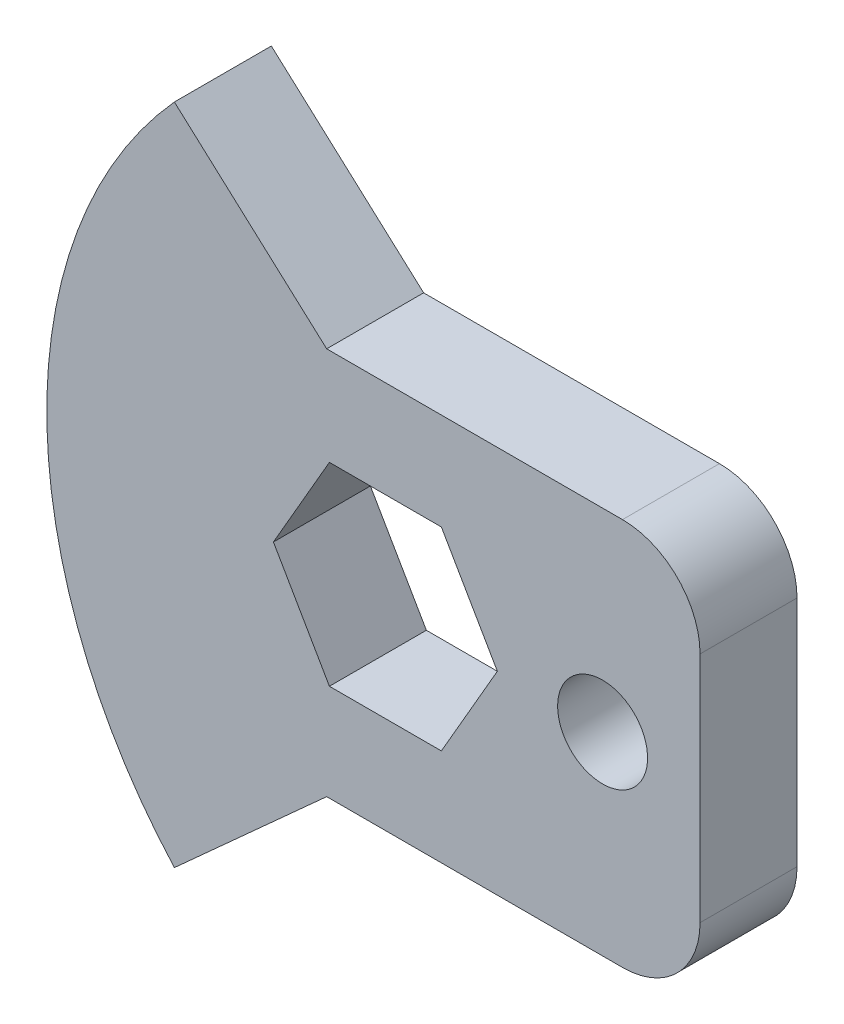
ISO-10303-21;
HEADER;
FILE_DESCRIPTION(('STEP AP214'),'2;1');
FILE_NAME('part.step','',(''),(''),'','','');
FILE_SCHEMA(('AUTOMOTIVE_DESIGN { 1 0 10303 214 1 1 1 1 }'));
ENDSEC;
DATA;
#1=APPLICATION_CONTEXT('core data for automotive mechanical design processes');
#2=APPLICATION_PROTOCOL_DEFINITION('international standard','automotive_design',2000,#1);
#3=PRODUCT_CONTEXT('',#1,'mechanical');
#4=PRODUCT('Part','Part','',(#3));
#5=PRODUCT_RELATED_PRODUCT_CATEGORY('part','',(#4));
#6=PRODUCT_DEFINITION_FORMATION('','',#4);
#7=PRODUCT_DEFINITION_CONTEXT('part definition',#1,'design');
#8=PRODUCT_DEFINITION('design','',#6,#7);
#9=PRODUCT_DEFINITION_SHAPE('','',#8);
#10=(LENGTH_UNIT() NAMED_UNIT(*) SI_UNIT(.MILLI.,.METRE.));
#11=(NAMED_UNIT(*) PLANE_ANGLE_UNIT() SI_UNIT($,.RADIAN.));
#12=(NAMED_UNIT(*) SI_UNIT($,.STERADIAN.) SOLID_ANGLE_UNIT());
#13=UNCERTAINTY_MEASURE_WITH_UNIT(LENGTH_MEASURE(1.E-05),#10,'distance_accuracy_value','');
#14=(GEOMETRIC_REPRESENTATION_CONTEXT(3) GLOBAL_UNCERTAINTY_ASSIGNED_CONTEXT((#13)) GLOBAL_UNIT_ASSIGNED_CONTEXT((#10,
#11,#12)) REPRESENTATION_CONTEXT('',''));
#15=CARTESIAN_POINT('',(0.,0.,0.));
#16=DIRECTION('',(0.,0.,1.));
#17=DIRECTION('',(1.,0.,0.));
#18=AXIS2_PLACEMENT_3D('',#15,#16,#17);
#19=CARTESIAN_POINT('',(0.,0.,-3.175));
#20=DIRECTION('',(0.,0.,1.));
#21=DIRECTION('',(1.,0.,0.));
#22=AXIS2_PLACEMENT_3D('',#19,#20,#21);
#23=PLANE('',#22);
#24=CARTESIAN_POINT('',(-3.19182579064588,6.35,-3.175));
#25=DIRECTION('',(0.,0.,-1.));
#26=DIRECTION('',(-1.,0.,0.));
#27=AXIS2_PLACEMENT_3D('',#24,#25,#26);
#28=CIRCLE('',#27,1.47319999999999);
#29=CARTESIAN_POINT('',(-4.66502579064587,6.35,-3.175));
#30=VERTEX_POINT('',#29);
#31=EDGE_CURVE('E165',#30,#30,#28,.T.);
#32=ORIENTED_EDGE('',*,*,#31,.F.);
#33=EDGE_LOOP('',(#32));
#34=FACE_BOUND('',#33,.T.);
#35=DIRECTION('',(-1.,0.,0.));
#36=VECTOR('',#35,1.);
#37=CARTESIAN_POINT('',(0.,0.,-3.175));
#38=LINE('',#37,#36);
#39=CARTESIAN_POINT('',(-2.54,0.,-3.175));
#40=VERTEX_POINT('',#39);
#41=CARTESIAN_POINT('',(-12.2262763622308,0.,-3.175));
#42=VERTEX_POINT('',#41);
#43=EDGE_CURVE('E220',#40,#42,#38,.T.);
#44=ORIENTED_EDGE('',*,*,#43,.T.);
#45=DIRECTION('',(0.742003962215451,0.670395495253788,0.));
#46=VECTOR('',#45,1.);
#47=CARTESIAN_POINT('',(-17.2133586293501,-4.50579465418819,-3.175));
#48=LINE('',#47,#46);
#49=CARTESIAN_POINT('',(-17.2133586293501,-4.50579465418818,-3.175));
#50=VERTEX_POINT('',#49);
#51=EDGE_CURVE('E152',#50,#42,#48,.T.);
#52=ORIENTED_EDGE('',*,*,#51,.F.);
#53=CARTESIAN_POINT('',(-5.19799948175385,6.35,-3.175));
#54=DIRECTION('',(0.,0.,1.));
#55=DIRECTION('',(1.,0.,0.));
#56=AXIS2_PLACEMENT_3D('',#53,#54,#55);
#57=CIRCLE('',#56,16.193119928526);
#58=CARTESIAN_POINT('',(-17.2133586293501,17.2057946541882,-3.175));
#59=VERTEX_POINT('',#58);
#60=EDGE_CURVE('E143',#59,#50,#57,.T.);
#61=ORIENTED_EDGE('',*,*,#60,.F.);
#62=DIRECTION('',(-0.74200396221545,0.670395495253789,0.));
#63=VECTOR('',#62,1.);
#64=CARTESIAN_POINT('',(-11.5592884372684,12.0973809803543,-3.175));
#65=LINE('',#64,#63);
#66=CARTESIAN_POINT('',(-12.2262763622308,12.7,-3.175));
#67=VERTEX_POINT('',#66);
#68=EDGE_CURVE('E136',#67,#59,#65,.T.);
#69=ORIENTED_EDGE('',*,*,#68,.F.);
#70=DIRECTION('',(1.,0.,0.));
#71=VECTOR('',#70,1.);
#72=CARTESIAN_POINT('',(0.,12.7,-3.175));
#73=LINE('',#72,#71);
#74=CARTESIAN_POINT('',(-2.54,12.7,-3.175));
#75=VERTEX_POINT('',#74);
#76=EDGE_CURVE('E48',#67,#75,#73,.T.);
#77=ORIENTED_EDGE('',*,*,#76,.T.);
#78=CARTESIAN_POINT('',(-2.54,10.16,-3.175));
#79=DIRECTION('',(0.,0.,1.));
#80=DIRECTION('',(1.,0.,0.));
#81=AXIS2_PLACEMENT_3D('',#78,#79,#80);
#82=CIRCLE('',#81,2.54);
#83=CARTESIAN_POINT('',(0.,10.16,-3.175));
#84=VERTEX_POINT('',#83);
#85=EDGE_CURVE('E237',#75,#84,#82,.F.);
#86=ORIENTED_EDGE('',*,*,#85,.T.);
#87=DIRECTION('',(0.,-1.,0.));
#88=VECTOR('',#87,1.);
#89=CARTESIAN_POINT('',(0.,0.,-3.175));
#90=LINE('',#89,#88);
#91=CARTESIAN_POINT('',(0.,2.54,-3.175));
#92=VERTEX_POINT('',#91);
#93=EDGE_CURVE('E218',#84,#92,#90,.T.);
#94=ORIENTED_EDGE('',*,*,#93,.T.);
#95=CARTESIAN_POINT('',(-2.54,2.54,-3.175));
#96=DIRECTION('',(0.,0.,1.));
#97=DIRECTION('',(1.,0.,0.));
#98=AXIS2_PLACEMENT_3D('',#95,#96,#97);
#99=CIRCLE('',#98,2.54);
#100=EDGE_CURVE('E239',#92,#40,#99,.F.);
#101=ORIENTED_EDGE('',*,*,#100,.T.);
#102=EDGE_LOOP('',(#44,#52,#61,#69,#77,#86,#94,#101));
#103=FACE_BOUND('',#102,.T.);
#104=DIRECTION('',(-0.5,0.866025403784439,0.));
#105=VECTOR('',#104,1.);
#106=CARTESIAN_POINT('',(-12.1369128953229,3.175,-3.175));
#107=LINE('',#106,#105);
#108=CARTESIAN_POINT('',(-12.1369128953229,3.175,-3.175));
#109=VERTEX_POINT('',#108);
#110=CARTESIAN_POINT('',(-13.97,6.35,-3.175));
#111=VERTEX_POINT('',#110);
#112=EDGE_CURVE('E173',#109,#111,#107,.T.);
#113=ORIENTED_EDGE('',*,*,#112,.F.);
#114=DIRECTION('',(-1.,0.,0.));
#115=VECTOR('',#114,1.);
#116=CARTESIAN_POINT('',(-8.47073868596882,3.175,-3.175));
#117=LINE('',#116,#115);
#118=CARTESIAN_POINT('',(-8.47073868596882,3.175,-3.175));
#119=VERTEX_POINT('',#118);
#120=EDGE_CURVE('E185',#119,#109,#117,.T.);
#121=ORIENTED_EDGE('',*,*,#120,.F.);
#122=DIRECTION('',(-0.5,-0.866025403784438,0.));
#123=VECTOR('',#122,1.);
#124=CARTESIAN_POINT('',(-6.63765158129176,6.35,-3.175));
#125=LINE('',#124,#123);
#126=CARTESIAN_POINT('',(-6.63765158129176,6.35,-3.175));
#127=VERTEX_POINT('',#126);
#128=EDGE_CURVE('E182',#127,#119,#125,.T.);
#129=ORIENTED_EDGE('',*,*,#128,.F.);
#130=DIRECTION('',(0.5,-0.866025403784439,0.));
#131=VECTOR('',#130,1.);
#132=CARTESIAN_POINT('',(-8.47073868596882,9.525,-3.175));
#133=LINE('',#132,#131);
#134=CARTESIAN_POINT('',(-8.47073868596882,9.525,-3.175));
#135=VERTEX_POINT('',#134);
#136=EDGE_CURVE('E180',#135,#127,#133,.T.);
#137=ORIENTED_EDGE('',*,*,#136,.F.);
#138=DIRECTION('',(1.,0.,0.));
#139=VECTOR('',#138,1.);
#140=CARTESIAN_POINT('',(-12.1369128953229,9.525,-3.175));
#141=LINE('',#140,#139);
#142=CARTESIAN_POINT('',(-12.1369128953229,9.525,-3.175));
#143=VERTEX_POINT('',#142);
#144=EDGE_CURVE('E178',#143,#135,#141,.T.);
#145=ORIENTED_EDGE('',*,*,#144,.F.);
#146=DIRECTION('',(0.5,0.866025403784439,0.));
#147=VECTOR('',#146,1.);
#148=CARTESIAN_POINT('',(-13.97,6.35,-3.175));
#149=LINE('',#148,#147);
#150=EDGE_CURVE('E175',#111,#143,#149,.T.);
#151=ORIENTED_EDGE('',*,*,#150,.F.);
#152=EDGE_LOOP('',(#113,#121,#129,#137,#145,#151));
#153=FACE_BOUND('',#152,.T.);
#154=ADVANCED_FACE('F33',(#34,#103,#153),#23,.F.);
#155=CARTESIAN_POINT('',(0.,0.,0.));
#156=DIRECTION('',(0.,0.,1.));
#157=DIRECTION('',(1.,0.,0.));
#158=AXIS2_PLACEMENT_3D('',#155,#156,#157);
#159=PLANE('',#158);
#160=DIRECTION('',(0.742003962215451,0.670395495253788,0.));
#161=VECTOR('',#160,1.);
#162=CARTESIAN_POINT('',(-17.2133586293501,-4.50579465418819,0.));
#163=LINE('',#162,#161);
#164=CARTESIAN_POINT('',(-17.2133586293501,-4.50579465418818,0.));
#165=VERTEX_POINT('',#164);
#166=CARTESIAN_POINT('',(-12.2262763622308,0.,0.));
#167=VERTEX_POINT('',#166);
#168=EDGE_CURVE('E144',#165,#167,#163,.T.);
#169=ORIENTED_EDGE('',*,*,#168,.T.);
#170=DIRECTION('',(-1.,0.,0.));
#171=VECTOR('',#170,1.);
#172=CARTESIAN_POINT('',(0.,0.,0.));
#173=LINE('',#172,#171);
#174=CARTESIAN_POINT('',(-2.54,0.,0.));
#175=VERTEX_POINT('',#174);
#176=EDGE_CURVE('E226',#175,#167,#173,.T.);
#177=ORIENTED_EDGE('',*,*,#176,.F.);
#178=CARTESIAN_POINT('',(-2.54,2.54,0.));
#179=DIRECTION('',(0.,0.,1.));
#180=DIRECTION('',(1.,0.,0.));
#181=AXIS2_PLACEMENT_3D('',#178,#179,#180);
#182=CIRCLE('',#181,2.54);
#183=CARTESIAN_POINT('',(0.,2.54,0.));
#184=VERTEX_POINT('',#183);
#185=EDGE_CURVE('E232',#175,#184,#182,.T.);
#186=ORIENTED_EDGE('',*,*,#185,.T.);
#187=DIRECTION('',(0.,-1.,0.));
#188=VECTOR('',#187,1.);
#189=CARTESIAN_POINT('',(0.,0.,0.));
#190=LINE('',#189,#188);
#191=CARTESIAN_POINT('',(0.,10.16,0.));
#192=VERTEX_POINT('',#191);
#193=EDGE_CURVE('E217',#192,#184,#190,.T.);
#194=ORIENTED_EDGE('',*,*,#193,.F.);
#195=CARTESIAN_POINT('',(-2.54,10.16,0.));
#196=DIRECTION('',(0.,0.,1.));
#197=DIRECTION('',(1.,0.,0.));
#198=AXIS2_PLACEMENT_3D('',#195,#196,#197);
#199=CIRCLE('',#198,2.54);
#200=CARTESIAN_POINT('',(-2.54,12.7,0.));
#201=VERTEX_POINT('',#200);
#202=EDGE_CURVE('E224',#192,#201,#199,.T.);
#203=ORIENTED_EDGE('',*,*,#202,.T.);
#204=DIRECTION('',(1.,0.,0.));
#205=VECTOR('',#204,1.);
#206=CARTESIAN_POINT('',(0.,12.7,0.));
#207=LINE('',#206,#205);
#208=CARTESIAN_POINT('',(-12.2262763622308,12.7,0.));
#209=VERTEX_POINT('',#208);
#210=EDGE_CURVE('E221',#209,#201,#207,.T.);
#211=ORIENTED_EDGE('',*,*,#210,.F.);
#212=DIRECTION('',(-0.74200396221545,0.670395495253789,0.));
#213=VECTOR('',#212,1.);
#214=CARTESIAN_POINT('',(-11.5592884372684,12.0973809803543,0.));
#215=LINE('',#214,#213);
#216=CARTESIAN_POINT('',(-17.2133586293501,17.2057946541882,0.));
#217=VERTEX_POINT('',#216);
#218=EDGE_CURVE('E160',#209,#217,#215,.T.);
#219=ORIENTED_EDGE('',*,*,#218,.T.);
#220=CARTESIAN_POINT('',(-5.19799948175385,6.35,0.));
#221=DIRECTION('',(0.,0.,1.));
#222=DIRECTION('',(1.,0.,0.));
#223=AXIS2_PLACEMENT_3D('',#220,#221,#222);
#224=CIRCLE('',#223,16.193119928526);
#225=EDGE_CURVE('E150',#217,#165,#224,.T.);
#226=ORIENTED_EDGE('',*,*,#225,.T.);
#227=EDGE_LOOP('',(#169,#177,#186,#194,#203,#211,#219,#226));
#228=FACE_BOUND('',#227,.T.);
#229=CARTESIAN_POINT('',(-3.19182579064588,6.35,0.));
#230=DIRECTION('',(0.,0.,-1.));
#231=DIRECTION('',(-1.,0.,0.));
#232=AXIS2_PLACEMENT_3D('',#229,#230,#231);
#233=CIRCLE('',#232,1.4732);
#234=CARTESIAN_POINT('',(-4.66502579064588,6.35,0.));
#235=VERTEX_POINT('',#234);
#236=EDGE_CURVE('E169',#235,#235,#233,.T.);
#237=ORIENTED_EDGE('',*,*,#236,.T.);
#238=EDGE_LOOP('',(#237));
#239=FACE_BOUND('',#238,.T.);
#240=DIRECTION('',(-1.,0.,0.));
#241=VECTOR('',#240,1.);
#242=CARTESIAN_POINT('',(-8.47073868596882,3.175,0.));
#243=LINE('',#242,#241);
#244=CARTESIAN_POINT('',(-8.47073868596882,3.175,0.));
#245=VERTEX_POINT('',#244);
#246=CARTESIAN_POINT('',(-12.1369128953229,3.175,0.));
#247=VERTEX_POINT('',#246);
#248=EDGE_CURVE('E176',#245,#247,#243,.T.);
#249=ORIENTED_EDGE('',*,*,#248,.T.);
#250=DIRECTION('',(-0.5,0.866025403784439,0.));
#251=VECTOR('',#250,1.);
#252=CARTESIAN_POINT('',(-12.1369128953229,3.175,0.));
#253=LINE('',#252,#251);
#254=CARTESIAN_POINT('',(-13.97,6.35,0.));
#255=VERTEX_POINT('',#254);
#256=EDGE_CURVE('E172',#247,#255,#253,.T.);
#257=ORIENTED_EDGE('',*,*,#256,.T.);
#258=DIRECTION('',(0.5,0.866025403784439,0.));
#259=VECTOR('',#258,1.);
#260=CARTESIAN_POINT('',(-13.97,6.35,0.));
#261=LINE('',#260,#259);
#262=CARTESIAN_POINT('',(-12.1369128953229,9.525,0.));
#263=VERTEX_POINT('',#262);
#264=EDGE_CURVE('E190',#255,#263,#261,.T.);
#265=ORIENTED_EDGE('',*,*,#264,.T.);
#266=DIRECTION('',(1.,0.,0.));
#267=VECTOR('',#266,1.);
#268=CARTESIAN_POINT('',(-12.1369128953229,9.525,0.));
#269=LINE('',#268,#267);
#270=CARTESIAN_POINT('',(-8.47073868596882,9.525,0.));
#271=VERTEX_POINT('',#270);
#272=EDGE_CURVE('E193',#263,#271,#269,.T.);
#273=ORIENTED_EDGE('',*,*,#272,.T.);
#274=DIRECTION('',(0.5,-0.866025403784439,0.));
#275=VECTOR('',#274,1.);
#276=CARTESIAN_POINT('',(-8.47073868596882,9.525,0.));
#277=LINE('',#276,#275);
#278=CARTESIAN_POINT('',(-6.63765158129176,6.35,0.));
#279=VERTEX_POINT('',#278);
#280=EDGE_CURVE('E196',#271,#279,#277,.T.);
#281=ORIENTED_EDGE('',*,*,#280,.T.);
#282=DIRECTION('',(-0.5,-0.866025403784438,0.));
#283=VECTOR('',#282,1.);
#284=CARTESIAN_POINT('',(-6.63765158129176,6.35,0.));
#285=LINE('',#284,#283);
#286=EDGE_CURVE('E199',#279,#245,#285,.T.);
#287=ORIENTED_EDGE('',*,*,#286,.T.);
#288=EDGE_LOOP('',(#249,#257,#265,#273,#281,#287));
#289=FACE_BOUND('',#288,.T.);
#290=ADVANCED_FACE('F250',(#228,#239,#289),#159,.T.);
#291=CARTESIAN_POINT('',(0.,0.,-3.175));
#292=DIRECTION('',(-1.,0.,0.));
#293=DIRECTION('',(0.,0.,1.));
#294=AXIS2_PLACEMENT_3D('',#291,#292,#293);
#295=PLANE('',#294);
#296=ORIENTED_EDGE('',*,*,#193,.T.);
#297=DIRECTION('',(0.,0.,1.));
#298=VECTOR('',#297,1.);
#299=CARTESIAN_POINT('',(0.,2.54,-3.175));
#300=LINE('',#299,#298);
#301=EDGE_CURVE('E56',#184,#92,#300,.F.);
#302=ORIENTED_EDGE('',*,*,#301,.T.);
#303=ORIENTED_EDGE('',*,*,#93,.F.);
#304=DIRECTION('',(0.,0.,1.));
#305=VECTOR('',#304,1.);
#306=CARTESIAN_POINT('',(0.,10.16,-3.175));
#307=LINE('',#306,#305);
#308=EDGE_CURVE('E241',#84,#192,#307,.T.);
#309=ORIENTED_EDGE('',*,*,#308,.T.);
#310=EDGE_LOOP('',(#296,#302,#303,#309));
#311=FACE_BOUND('',#310,.T.);
#312=ADVANCED_FACE('F258',(#311),#295,.F.);
#313=CARTESIAN_POINT('',(0.,0.,-3.175));
#314=DIRECTION('',(0.,1.,0.));
#315=DIRECTION('',(0.,0.,1.));
#316=AXIS2_PLACEMENT_3D('',#313,#314,#315);
#317=PLANE('',#316);
#318=ORIENTED_EDGE('',*,*,#176,.T.);
#319=DIRECTION('',(0.,0.,-1.));
#320=VECTOR('',#319,1.);
#321=CARTESIAN_POINT('',(-12.2262763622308,0.,-3.175));
#322=LINE('',#321,#320);
#323=EDGE_CURVE('E11',#167,#42,#322,.T.);
#324=ORIENTED_EDGE('',*,*,#323,.T.);
#325=ORIENTED_EDGE('',*,*,#43,.F.);
#326=DIRECTION('',(0.,0.,1.));
#327=VECTOR('',#326,1.);
#328=CARTESIAN_POINT('',(-2.54,0.,-3.175));
#329=LINE('',#328,#327);
#330=EDGE_CURVE('E234',#40,#175,#329,.T.);
#331=ORIENTED_EDGE('',*,*,#330,.T.);
#332=EDGE_LOOP('',(#318,#324,#325,#331));
#333=FACE_BOUND('',#332,.T.);
#334=ADVANCED_FACE('F264',(#333),#317,.F.);
#335=CARTESIAN_POINT('',(0.,12.7,-3.175));
#336=DIRECTION('',(0.,-1.,0.));
#337=DIRECTION('',(0.,0.,-1.));
#338=AXIS2_PLACEMENT_3D('',#335,#336,#337);
#339=PLANE('',#338);
#340=ORIENTED_EDGE('',*,*,#76,.F.);
#341=DIRECTION('',(0.,0.,1.));
#342=VECTOR('',#341,1.);
#343=CARTESIAN_POINT('',(-12.2262763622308,12.7,-3.175));
#344=LINE('',#343,#342);
#345=EDGE_CURVE('E41',#67,#209,#344,.T.);
#346=ORIENTED_EDGE('',*,*,#345,.T.);
#347=ORIENTED_EDGE('',*,*,#210,.T.);
#348=DIRECTION('',(0.,0.,1.));
#349=VECTOR('',#348,1.);
#350=CARTESIAN_POINT('',(-2.54,12.7,-3.175));
#351=LINE('',#350,#349);
#352=EDGE_CURVE('E245',#201,#75,#351,.F.);
#353=ORIENTED_EDGE('',*,*,#352,.T.);
#354=EDGE_LOOP('',(#340,#346,#347,#353));
#355=FACE_BOUND('',#354,.T.);
#356=ADVANCED_FACE('F248',(#355),#339,.F.);
#357=CARTESIAN_POINT('',(-12.1369128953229,3.175,-3.175));
#358=DIRECTION('',(0.866025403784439,0.5,0.));
#359=DIRECTION('',(-0.5,0.866025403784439,0.));
#360=AXIS2_PLACEMENT_3D('',#357,#358,#359);
#361=PLANE('',#360);
#362=ORIENTED_EDGE('',*,*,#256,.F.);
#363=DIRECTION('',(0.,0.,1.));
#364=VECTOR('',#363,1.);
#365=CARTESIAN_POINT('',(-12.1369128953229,3.175,-3.175));
#366=LINE('',#365,#364);
#367=EDGE_CURVE('E187',#109,#247,#366,.T.);
#368=ORIENTED_EDGE('',*,*,#367,.F.);
#369=ORIENTED_EDGE('',*,*,#112,.T.);
#370=DIRECTION('',(0.,0.,1.));
#371=VECTOR('',#370,1.);
#372=CARTESIAN_POINT('',(-13.97,6.35,-3.175));
#373=LINE('',#372,#371);
#374=EDGE_CURVE('E214',#111,#255,#373,.T.);
#375=ORIENTED_EDGE('',*,*,#374,.T.);
#376=EDGE_LOOP('',(#362,#368,#369,#375));
#377=FACE_BOUND('',#376,.T.);
#378=ADVANCED_FACE('F286',(#377),#361,.T.);
#379=CARTESIAN_POINT('',(-13.97,6.35,-3.175));
#380=DIRECTION('',(0.866025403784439,-0.5,0.));
#381=DIRECTION('',(0.5,0.866025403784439,0.));
#382=AXIS2_PLACEMENT_3D('',#379,#380,#381);
#383=PLANE('',#382);
#384=ORIENTED_EDGE('',*,*,#264,.F.);
#385=ORIENTED_EDGE('',*,*,#374,.F.);
#386=ORIENTED_EDGE('',*,*,#150,.T.);
#387=DIRECTION('',(0.,0.,1.));
#388=VECTOR('',#387,1.);
#389=CARTESIAN_POINT('',(-12.1369128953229,9.525,-3.175));
#390=LINE('',#389,#388);
#391=EDGE_CURVE('E212',#143,#263,#390,.T.);
#392=ORIENTED_EDGE('',*,*,#391,.T.);
#393=EDGE_LOOP('',(#384,#385,#386,#392));
#394=FACE_BOUND('',#393,.T.);
#395=ADVANCED_FACE('F320',(#394),#383,.T.);
#396=CARTESIAN_POINT('',(-12.1369128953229,9.525,-3.175));
#397=DIRECTION('',(0.,-1.,0.));
#398=DIRECTION('',(0.,0.,-1.));
#399=AXIS2_PLACEMENT_3D('',#396,#397,#398);
#400=PLANE('',#399);
#401=ORIENTED_EDGE('',*,*,#272,.F.);
#402=ORIENTED_EDGE('',*,*,#391,.F.);
#403=ORIENTED_EDGE('',*,*,#144,.T.);
#404=DIRECTION('',(0.,0.,1.));
#405=VECTOR('',#404,1.);
#406=CARTESIAN_POINT('',(-8.47073868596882,9.525,-3.175));
#407=LINE('',#406,#405);
#408=EDGE_CURVE('E210',#135,#271,#407,.T.);
#409=ORIENTED_EDGE('',*,*,#408,.T.);
#410=EDGE_LOOP('',(#401,#402,#403,#409));
#411=FACE_BOUND('',#410,.T.);
#412=ADVANCED_FACE('F317',(#411),#400,.T.);
#413=CARTESIAN_POINT('',(-8.47073868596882,9.525,-3.175));
#414=DIRECTION('',(-0.866025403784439,-0.5,0.));
#415=DIRECTION('',(0.5,-0.866025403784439,0.));
#416=AXIS2_PLACEMENT_3D('',#413,#414,#415);
#417=PLANE('',#416);
#418=ORIENTED_EDGE('',*,*,#280,.F.);
#419=ORIENTED_EDGE('',*,*,#408,.F.);
#420=ORIENTED_EDGE('',*,*,#136,.T.);
#421=DIRECTION('',(0.,0.,1.));
#422=VECTOR('',#421,1.);
#423=CARTESIAN_POINT('',(-6.63765158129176,6.35,-3.175));
#424=LINE('',#423,#422);
#425=EDGE_CURVE('E208',#127,#279,#424,.T.);
#426=ORIENTED_EDGE('',*,*,#425,.T.);
#427=EDGE_LOOP('',(#418,#419,#420,#426));
#428=FACE_BOUND('',#427,.T.);
#429=ADVANCED_FACE('F313',(#428),#417,.T.);
#430=CARTESIAN_POINT('',(-6.63765158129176,6.35,-3.175));
#431=DIRECTION('',(-0.866025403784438,0.5,0.));
#432=DIRECTION('',(-0.5,-0.866025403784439,0.));
#433=AXIS2_PLACEMENT_3D('',#430,#431,#432);
#434=PLANE('',#433);
#435=ORIENTED_EDGE('',*,*,#286,.F.);
#436=ORIENTED_EDGE('',*,*,#425,.F.);
#437=ORIENTED_EDGE('',*,*,#128,.T.);
#438=DIRECTION('',(0.,0.,1.));
#439=VECTOR('',#438,1.);
#440=CARTESIAN_POINT('',(-8.47073868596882,3.175,-3.175));
#441=LINE('',#440,#439);
#442=EDGE_CURVE('E206',#119,#245,#441,.T.);
#443=ORIENTED_EDGE('',*,*,#442,.T.);
#444=EDGE_LOOP('',(#435,#436,#437,#443));
#445=FACE_BOUND('',#444,.T.);
#446=ADVANCED_FACE('F305',(#445),#434,.T.);
#447=CARTESIAN_POINT('',(-8.47073868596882,3.175,-3.175));
#448=DIRECTION('',(0.,1.,0.));
#449=DIRECTION('',(-1.,0.,0.));
#450=AXIS2_PLACEMENT_3D('',#447,#448,#449);
#451=PLANE('',#450);
#452=ORIENTED_EDGE('',*,*,#248,.F.);
#453=ORIENTED_EDGE('',*,*,#442,.F.);
#454=ORIENTED_EDGE('',*,*,#120,.T.);
#455=ORIENTED_EDGE('',*,*,#367,.T.);
#456=EDGE_LOOP('',(#452,#453,#454,#455));
#457=FACE_BOUND('',#456,.T.);
#458=ADVANCED_FACE('F299',(#457),#451,.T.);
#459=CARTESIAN_POINT('',(-3.19182579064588,6.35,-3.175));
#460=DIRECTION('',(0.,0.,-1.));
#461=DIRECTION('',(-1.,0.,0.));
#462=AXIS2_PLACEMENT_3D('',#459,#460,#461);
#463=CYLINDRICAL_SURFACE('',#462,1.47319999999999);
#464=ORIENTED_EDGE('',*,*,#236,.F.);
#465=EDGE_LOOP('',(#464));
#466=FACE_BOUND('',#465,.T.);
#467=ORIENTED_EDGE('',*,*,#31,.T.);
#468=EDGE_LOOP('',(#467));
#469=FACE_BOUND('',#468,.T.);
#470=ADVANCED_FACE('F295',(#466,#469),#463,.F.);
#471=CARTESIAN_POINT('',(-2.54,2.54,-3.175));
#472=DIRECTION('',(0.,0.,1.));
#473=DIRECTION('',(1.,0.,0.));
#474=AXIS2_PLACEMENT_3D('',#471,#472,#473);
#475=CYLINDRICAL_SURFACE('',#474,2.54);
#476=ORIENTED_EDGE('',*,*,#100,.F.);
#477=ORIENTED_EDGE('',*,*,#301,.F.);
#478=ORIENTED_EDGE('',*,*,#185,.F.);
#479=ORIENTED_EDGE('',*,*,#330,.F.);
#480=EDGE_LOOP('',(#476,#477,#478,#479));
#481=FACE_BOUND('',#480,.T.);
#482=ADVANCED_FACE('F260',(#481),#475,.T.);
#483=CARTESIAN_POINT('',(-2.54,10.16,-3.175));
#484=DIRECTION('',(0.,0.,1.));
#485=DIRECTION('',(1.,0.,0.));
#486=AXIS2_PLACEMENT_3D('',#483,#484,#485);
#487=CYLINDRICAL_SURFACE('',#486,2.54);
#488=ORIENTED_EDGE('',*,*,#85,.F.);
#489=ORIENTED_EDGE('',*,*,#352,.F.);
#490=ORIENTED_EDGE('',*,*,#202,.F.);
#491=ORIENTED_EDGE('',*,*,#308,.F.);
#492=EDGE_LOOP('',(#488,#489,#490,#491));
#493=FACE_BOUND('',#492,.T.);
#494=ADVANCED_FACE('F35',(#493),#487,.T.);
#495=CARTESIAN_POINT('',(-17.2133586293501,-4.50579465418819,-3.175));
#496=DIRECTION('',(0.670395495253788,-0.742003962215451,0.));
#497=DIRECTION('',(0.742003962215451,0.670395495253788,0.));
#498=AXIS2_PLACEMENT_3D('',#495,#496,#497);
#499=PLANE('',#498);
#500=ORIENTED_EDGE('',*,*,#323,.F.);
#501=ORIENTED_EDGE('',*,*,#168,.F.);
#502=DIRECTION('',(0.,0.,1.));
#503=VECTOR('',#502,1.);
#504=CARTESIAN_POINT('',(-17.2133586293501,-4.50579465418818,-3.175));
#505=LINE('',#504,#503);
#506=EDGE_CURVE('E151',#50,#165,#505,.T.);
#507=ORIENTED_EDGE('',*,*,#506,.F.);
#508=ORIENTED_EDGE('',*,*,#51,.T.);
#509=EDGE_LOOP('',(#500,#501,#507,#508));
#510=FACE_BOUND('',#509,.T.);
#511=ADVANCED_FACE('F268',(#510),#499,.T.);
#512=CARTESIAN_POINT('',(-11.5592884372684,12.0973809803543,-3.175));
#513=DIRECTION('',(0.670395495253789,0.74200396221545,0.));
#514=DIRECTION('',(-0.74200396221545,0.670395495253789,0.));
#515=AXIS2_PLACEMENT_3D('',#512,#513,#514);
#516=PLANE('',#515);
#517=ORIENTED_EDGE('',*,*,#345,.F.);
#518=ORIENTED_EDGE('',*,*,#68,.T.);
#519=DIRECTION('',(0.,0.,1.));
#520=VECTOR('',#519,1.);
#521=CARTESIAN_POINT('',(-17.2133586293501,17.2057946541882,-3.175));
#522=LINE('',#521,#520);
#523=EDGE_CURVE('E139',#59,#217,#522,.T.);
#524=ORIENTED_EDGE('',*,*,#523,.T.);
#525=ORIENTED_EDGE('',*,*,#218,.F.);
#526=EDGE_LOOP('',(#517,#518,#524,#525));
#527=FACE_BOUND('',#526,.T.);
#528=ADVANCED_FACE('F138',(#527),#516,.T.);
#529=CARTESIAN_POINT('',(-5.19799948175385,6.35,-3.175));
#530=DIRECTION('',(0.,0.,1.));
#531=DIRECTION('',(1.,0.,0.));
#532=AXIS2_PLACEMENT_3D('',#529,#530,#531);
#533=CYLINDRICAL_SURFACE('',#532,16.193119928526);
#534=ORIENTED_EDGE('',*,*,#225,.F.);
#535=ORIENTED_EDGE('',*,*,#523,.F.);
#536=ORIENTED_EDGE('',*,*,#60,.T.);
#537=ORIENTED_EDGE('',*,*,#506,.T.);
#538=EDGE_LOOP('',(#534,#535,#536,#537));
#539=FACE_BOUND('',#538,.T.);
#540=ADVANCED_FACE('F148',(#539),#533,.T.);
#541=CLOSED_SHELL('',(#154,#290,#312,#334,#356,#378,#395,#412,#429,#446,#458,#470,#482,#494,
#511,#528,#540));
#542=MANIFOLD_SOLID_BREP('B2',#541);
#543=ADVANCED_BREP_SHAPE_REPRESENTATION('',(#18,#542),#14);
#544=SHAPE_DEFINITION_REPRESENTATION(#9,#543);
ENDSEC;
END-ISO-10303-21;
